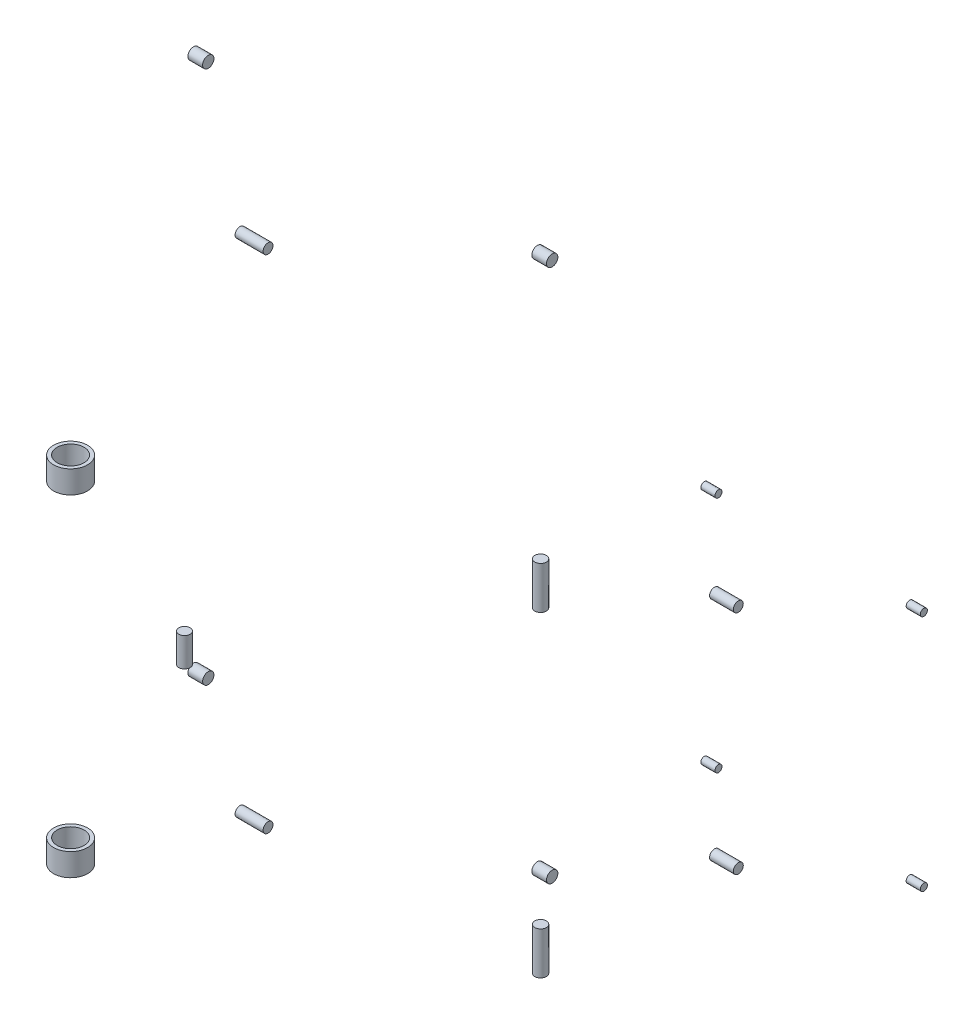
ISO-10303-21;
HEADER;
FILE_DESCRIPTION(('STEP AP214'),'2;1');
FILE_NAME('part.step','',(''),(''),'','','');
FILE_SCHEMA(('AUTOMOTIVE_DESIGN { 1 0 10303 214 1 1 1 1 }'));
ENDSEC;
DATA;
#1=APPLICATION_CONTEXT('core data for automotive mechanical design processes');
#2=APPLICATION_PROTOCOL_DEFINITION('international standard','automotive_design',2000,#1);
#3=PRODUCT_CONTEXT('',#1,'mechanical');
#4=PRODUCT('Part','Part','',(#3));
#5=PRODUCT_RELATED_PRODUCT_CATEGORY('part','',(#4));
#6=PRODUCT_DEFINITION_FORMATION('','',#4);
#7=PRODUCT_DEFINITION_CONTEXT('part definition',#1,'design');
#8=PRODUCT_DEFINITION('design','',#6,#7);
#9=PRODUCT_DEFINITION_SHAPE('','',#8);
#10=(LENGTH_UNIT() NAMED_UNIT(*) SI_UNIT(.MILLI.,.METRE.));
#11=(NAMED_UNIT(*) PLANE_ANGLE_UNIT() SI_UNIT($,.RADIAN.));
#12=(NAMED_UNIT(*) SI_UNIT($,.STERADIAN.) SOLID_ANGLE_UNIT());
#13=UNCERTAINTY_MEASURE_WITH_UNIT(LENGTH_MEASURE(1.E-05),#10,'distance_accuracy_value','');
#14=(GEOMETRIC_REPRESENTATION_CONTEXT(3) GLOBAL_UNCERTAINTY_ASSIGNED_CONTEXT((#13)) GLOBAL_UNIT_ASSIGNED_CONTEXT((#10,
#11,#12)) REPRESENTATION_CONTEXT('',''));
#15=CARTESIAN_POINT('',(0.,0.,0.));
#16=DIRECTION('',(0.,0.,1.));
#17=DIRECTION('',(1.,0.,0.));
#18=AXIS2_PLACEMENT_3D('',#15,#16,#17);
#19=CARTESIAN_POINT('',(-122.,545.,2430.));
#20=DIRECTION('',(0.,1.,0.));
#21=DIRECTION('',(0.,0.,1.));
#22=AXIS2_PLACEMENT_3D('',#19,#20,#21);
#23=CYLINDRICAL_SURFACE('',#22,60.);
#24=CARTESIAN_POINT('',(-122.,545.,2430.));
#25=DIRECTION('',(0.,1.,0.));
#26=DIRECTION('',(0.,0.,1.));
#27=AXIS2_PLACEMENT_3D('',#24,#25,#26);
#28=CIRCLE('',#27,60.);
#29=CARTESIAN_POINT('',(-122.,545.,2490.));
#30=VERTEX_POINT('',#29);
#31=EDGE_CURVE('E11',#30,#30,#28,.T.);
#32=ORIENTED_EDGE('',*,*,#31,.T.);
#33=EDGE_LOOP('',(#32));
#34=FACE_BOUND('',#33,.T.);
#35=CARTESIAN_POINT('',(-122.,625.,2430.));
#36=DIRECTION('',(0.,1.,0.));
#37=DIRECTION('',(0.,0.,1.));
#38=AXIS2_PLACEMENT_3D('',#35,#36,#37);
#39=CIRCLE('',#38,60.);
#40=CARTESIAN_POINT('',(-122.,625.,2490.));
#41=VERTEX_POINT('',#40);
#42=EDGE_CURVE('E46',#41,#41,#39,.T.);
#43=ORIENTED_EDGE('',*,*,#42,.F.);
#44=EDGE_LOOP('',(#43));
#45=FACE_BOUND('',#44,.T.);
#46=ADVANCED_FACE('F43',(#34,#45),#23,.T.);
#47=CARTESIAN_POINT('',(-122.,545.,2430.));
#48=DIRECTION('',(0.,1.,0.));
#49=DIRECTION('',(0.,0.,1.));
#50=AXIS2_PLACEMENT_3D('',#47,#48,#49);
#51=PLANE('',#50);
#52=CARTESIAN_POINT('',(-122.,545.,2430.));
#53=DIRECTION('',(0.,1.,0.));
#54=DIRECTION('',(0.,0.,1.));
#55=AXIS2_PLACEMENT_3D('',#52,#53,#54);
#56=CIRCLE('',#55,47.5);
#57=CARTESIAN_POINT('',(-122.,545.,2477.5));
#58=VERTEX_POINT('',#57);
#59=EDGE_CURVE('E53',#58,#58,#56,.T.);
#60=ORIENTED_EDGE('',*,*,#59,.T.);
#61=EDGE_LOOP('',(#60));
#62=FACE_BOUND('',#61,.T.);
#63=ORIENTED_EDGE('',*,*,#31,.F.);
#64=EDGE_LOOP('',(#63));
#65=FACE_BOUND('',#64,.T.);
#66=ADVANCED_FACE('F61',(#62,#65),#51,.F.);
#67=CARTESIAN_POINT('',(-122.,625.,2430.));
#68=DIRECTION('',(0.,1.,0.));
#69=DIRECTION('',(0.,0.,1.));
#70=AXIS2_PLACEMENT_3D('',#67,#68,#69);
#71=PLANE('',#70);
#72=CARTESIAN_POINT('',(-122.,625.,2430.));
#73=DIRECTION('',(0.,1.,0.));
#74=DIRECTION('',(0.,0.,1.));
#75=AXIS2_PLACEMENT_3D('',#72,#73,#74);
#76=CIRCLE('',#75,47.5);
#77=CARTESIAN_POINT('',(-122.,625.,2477.5));
#78=VERTEX_POINT('',#77);
#79=EDGE_CURVE('E55',#78,#78,#76,.T.);
#80=ORIENTED_EDGE('',*,*,#79,.F.);
#81=EDGE_LOOP('',(#80));
#82=FACE_BOUND('',#81,.T.);
#83=ORIENTED_EDGE('',*,*,#42,.T.);
#84=EDGE_LOOP('',(#83));
#85=FACE_BOUND('',#84,.T.);
#86=ADVANCED_FACE('F67',(#82,#85),#71,.T.);
#87=CARTESIAN_POINT('',(-122.,545.,2430.));
#88=DIRECTION('',(0.,1.,0.));
#89=DIRECTION('',(0.,0.,1.));
#90=AXIS2_PLACEMENT_3D('',#87,#88,#89);
#91=CYLINDRICAL_SURFACE('',#90,47.5);
#92=ORIENTED_EDGE('',*,*,#59,.F.);
#93=EDGE_LOOP('',(#92));
#94=FACE_BOUND('',#93,.T.);
#95=ORIENTED_EDGE('',*,*,#79,.T.);
#96=EDGE_LOOP('',(#95));
#97=FACE_BOUND('',#96,.T.);
#98=ADVANCED_FACE('F64',(#94,#97),#91,.F.);
#99=CLOSED_SHELL('',(#46,#66,#86,#98));
#100=MANIFOLD_SOLID_BREP('B2',#99);
#101=CARTESIAN_POINT('',(-122.,-545.,2430.));
#102=DIRECTION('',(0.,1.,0.));
#103=DIRECTION('',(0.,0.,1.));
#104=AXIS2_PLACEMENT_3D('',#101,#102,#103);
#105=PLANE('',#104);
#106=CARTESIAN_POINT('',(-122.,-545.,2430.));
#107=DIRECTION('',(0.,1.,0.));
#108=DIRECTION('',(0.,0.,1.));
#109=AXIS2_PLACEMENT_3D('',#106,#107,#108);
#110=CIRCLE('',#109,60.);
#111=CARTESIAN_POINT('',(-122.,-545.,2490.));
#112=VERTEX_POINT('',#111);
#113=EDGE_CURVE('E42',#112,#112,#110,.T.);
#114=ORIENTED_EDGE('',*,*,#113,.T.);
#115=EDGE_LOOP('',(#114));
#116=FACE_BOUND('',#115,.T.);
#117=CARTESIAN_POINT('',(-122.,-545.,2430.));
#118=DIRECTION('',(0.,1.,0.));
#119=DIRECTION('',(0.,0.,1.));
#120=AXIS2_PLACEMENT_3D('',#117,#118,#119);
#121=CIRCLE('',#120,47.5);
#122=CARTESIAN_POINT('',(-122.,-545.,2477.5));
#123=VERTEX_POINT('',#122);
#124=EDGE_CURVE('E123',#123,#123,#121,.T.);
#125=ORIENTED_EDGE('',*,*,#124,.F.);
#126=EDGE_LOOP('',(#125));
#127=FACE_BOUND('',#126,.T.);
#128=ADVANCED_FACE('F112',(#116,#127),#105,.T.);
#129=CARTESIAN_POINT('',(-122.,-625.,2430.));
#130=DIRECTION('',(0.,1.,0.));
#131=DIRECTION('',(0.,0.,1.));
#132=AXIS2_PLACEMENT_3D('',#129,#130,#131);
#133=PLANE('',#132);
#134=CARTESIAN_POINT('',(-122.,-625.,2430.));
#135=DIRECTION('',(0.,1.,0.));
#136=DIRECTION('',(0.,0.,1.));
#137=AXIS2_PLACEMENT_3D('',#134,#135,#136);
#138=CIRCLE('',#137,60.);
#139=CARTESIAN_POINT('',(-122.,-625.,2490.));
#140=VERTEX_POINT('',#139);
#141=EDGE_CURVE('E116',#140,#140,#138,.T.);
#142=ORIENTED_EDGE('',*,*,#141,.F.);
#143=EDGE_LOOP('',(#142));
#144=FACE_BOUND('',#143,.T.);
#145=CARTESIAN_POINT('',(-122.,-625.,2430.));
#146=DIRECTION('',(0.,1.,0.));
#147=DIRECTION('',(0.,0.,1.));
#148=AXIS2_PLACEMENT_3D('',#145,#146,#147);
#149=CIRCLE('',#148,47.5);
#150=CARTESIAN_POINT('',(-122.,-625.,2477.5));
#151=VERTEX_POINT('',#150);
#152=EDGE_CURVE('E125',#151,#151,#149,.T.);
#153=ORIENTED_EDGE('',*,*,#152,.T.);
#154=EDGE_LOOP('',(#153));
#155=FACE_BOUND('',#154,.T.);
#156=ADVANCED_FACE('F135',(#144,#155),#133,.F.);
#157=CARTESIAN_POINT('',(-122.,-545.,2430.));
#158=DIRECTION('',(0.,-1.,0.));
#159=DIRECTION('',(0.,0.,-1.));
#160=AXIS2_PLACEMENT_3D('',#157,#158,#159);
#161=CYLINDRICAL_SURFACE('',#160,60.);
#162=ORIENTED_EDGE('',*,*,#113,.F.);
#163=EDGE_LOOP('',(#162));
#164=FACE_BOUND('',#163,.T.);
#165=ORIENTED_EDGE('',*,*,#141,.T.);
#166=EDGE_LOOP('',(#165));
#167=FACE_BOUND('',#166,.T.);
#168=ADVANCED_FACE('F114',(#164,#167),#161,.T.);
#169=CARTESIAN_POINT('',(-122.,-545.,2430.));
#170=DIRECTION('',(0.,-1.,0.));
#171=DIRECTION('',(0.,0.,-1.));
#172=AXIS2_PLACEMENT_3D('',#169,#170,#171);
#173=CYLINDRICAL_SURFACE('',#172,47.5);
#174=ORIENTED_EDGE('',*,*,#124,.T.);
#175=EDGE_LOOP('',(#174));
#176=FACE_BOUND('',#175,.T.);
#177=ORIENTED_EDGE('',*,*,#152,.F.);
#178=EDGE_LOOP('',(#177));
#179=FACE_BOUND('',#178,.T.);
#180=ADVANCED_FACE('F131',(#176,#179),#173,.F.);
#181=CLOSED_SHELL('',(#128,#156,#168,#180));
#182=MANIFOLD_SOLID_BREP('B6',#181);
#183=CARTESIAN_POINT('',(380.,388.,2530.));
#184=DIRECTION('',(0.,-1.,0.));
#185=DIRECTION('',(0.,0.,-1.));
#186=AXIS2_PLACEMENT_3D('',#183,#184,#185);
#187=CYLINDRICAL_SURFACE('',#186,20.);
#188=CARTESIAN_POINT('',(380.,388.,2530.));
#189=DIRECTION('',(0.,1.,0.));
#190=DIRECTION('',(0.,0.,1.));
#191=AXIS2_PLACEMENT_3D('',#188,#189,#190);
#192=CIRCLE('',#191,20.);
#193=CARTESIAN_POINT('',(380.,388.,2550.));
#194=VERTEX_POINT('',#193);
#195=EDGE_CURVE('E111',#194,#194,#192,.T.);
#196=ORIENTED_EDGE('',*,*,#195,.F.);
#197=EDGE_LOOP('',(#196));
#198=FACE_BOUND('',#197,.T.);
#199=CARTESIAN_POINT('',(380.,286.,2530.));
#200=DIRECTION('',(0.,1.,0.));
#201=DIRECTION('',(0.,0.,1.));
#202=AXIS2_PLACEMENT_3D('',#199,#200,#201);
#203=CIRCLE('',#202,20.);
#204=CARTESIAN_POINT('',(380.,286.,2550.));
#205=VERTEX_POINT('',#204);
#206=EDGE_CURVE('E184',#205,#205,#203,.T.);
#207=ORIENTED_EDGE('',*,*,#206,.T.);
#208=EDGE_LOOP('',(#207));
#209=FACE_BOUND('',#208,.T.);
#210=ADVANCED_FACE('F181',(#198,#209),#187,.T.);
#211=CARTESIAN_POINT('',(380.,388.,2530.));
#212=DIRECTION('',(0.,1.,0.));
#213=DIRECTION('',(0.,0.,1.));
#214=AXIS2_PLACEMENT_3D('',#211,#212,#213);
#215=PLANE('',#214);
#216=ORIENTED_EDGE('',*,*,#195,.T.);
#217=EDGE_LOOP('',(#216));
#218=FACE_BOUND('',#217,.T.);
#219=ADVANCED_FACE('F196',(#218),#215,.T.);
#220=CARTESIAN_POINT('',(380.,286.,2530.));
#221=DIRECTION('',(0.,1.,0.));
#222=DIRECTION('',(0.,0.,1.));
#223=AXIS2_PLACEMENT_3D('',#220,#221,#222);
#224=PLANE('',#223);
#225=ORIENTED_EDGE('',*,*,#206,.F.);
#226=EDGE_LOOP('',(#225));
#227=FACE_BOUND('',#226,.T.);
#228=ADVANCED_FACE('F194',(#227),#224,.F.);
#229=CLOSED_SHELL('',(#210,#219,#228));
#230=MANIFOLD_SOLID_BREP('B37',#229);
#231=CARTESIAN_POINT('',(1033.,483.475221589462,1926.));
#232=DIRECTION('',(0.,1.,0.));
#233=DIRECTION('',(0.,0.,1.));
#234=AXIS2_PLACEMENT_3D('',#231,#232,#233);
#235=CYLINDRICAL_SURFACE('',#234,20.5);
#236=CARTESIAN_POINT('',(1033.,483.475221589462,1926.));
#237=DIRECTION('',(0.,1.,0.));
#238=DIRECTION('',(0.,0.,1.));
#239=AXIS2_PLACEMENT_3D('',#236,#237,#238);
#240=CIRCLE('',#239,20.5);
#241=CARTESIAN_POINT('',(1033.,483.475221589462,1946.5));
#242=VERTEX_POINT('',#241);
#243=EDGE_CURVE('E180',#242,#242,#240,.T.);
#244=ORIENTED_EDGE('',*,*,#243,.T.);
#245=EDGE_LOOP('',(#244));
#246=FACE_BOUND('',#245,.T.);
#247=CARTESIAN_POINT('',(1033.,633.475221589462,1926.));
#248=DIRECTION('',(0.,1.,0.));
#249=DIRECTION('',(0.,0.,1.));
#250=AXIS2_PLACEMENT_3D('',#247,#248,#249);
#251=CIRCLE('',#250,20.5);
#252=CARTESIAN_POINT('',(1033.,633.475221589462,1946.5));
#253=VERTEX_POINT('',#252);
#254=EDGE_CURVE('E232',#253,#253,#251,.T.);
#255=ORIENTED_EDGE('',*,*,#254,.F.);
#256=EDGE_LOOP('',(#255));
#257=FACE_BOUND('',#256,.T.);
#258=ADVANCED_FACE('F229',(#246,#257),#235,.T.);
#259=CARTESIAN_POINT('',(1033.,483.475221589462,1926.));
#260=DIRECTION('',(0.,1.,0.));
#261=DIRECTION('',(0.,0.,1.));
#262=AXIS2_PLACEMENT_3D('',#259,#260,#261);
#263=PLANE('',#262);
#264=ORIENTED_EDGE('',*,*,#243,.F.);
#265=EDGE_LOOP('',(#264));
#266=FACE_BOUND('',#265,.T.);
#267=ADVANCED_FACE('F244',(#266),#263,.F.);
#268=CARTESIAN_POINT('',(1033.,633.475221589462,1926.));
#269=DIRECTION('',(0.,1.,0.));
#270=DIRECTION('',(0.,0.,1.));
#271=AXIS2_PLACEMENT_3D('',#268,#269,#270);
#272=PLANE('',#271);
#273=ORIENTED_EDGE('',*,*,#254,.T.);
#274=EDGE_LOOP('',(#273));
#275=FACE_BOUND('',#274,.T.);
#276=ADVANCED_FACE('F241',(#275),#272,.T.);
#277=CLOSED_SHELL('',(#258,#267,#276));
#278=MANIFOLD_SOLID_BREP('B106',#277);
#279=CARTESIAN_POINT('',(1033.,-483.841980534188,1926.));
#280=DIRECTION('',(0.,-1.,0.));
#281=DIRECTION('',(0.,0.,-1.));
#282=AXIS2_PLACEMENT_3D('',#279,#280,#281);
#283=CYLINDRICAL_SURFACE('',#282,20.5);
#284=CARTESIAN_POINT('',(1033.,-483.841980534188,1926.));
#285=DIRECTION('',(0.,1.,0.));
#286=DIRECTION('',(0.,0.,1.));
#287=AXIS2_PLACEMENT_3D('',#284,#285,#286);
#288=CIRCLE('',#287,20.5);
#289=CARTESIAN_POINT('',(1033.,-483.841980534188,1946.5));
#290=VERTEX_POINT('',#289);
#291=EDGE_CURVE('E228',#290,#290,#288,.T.);
#292=ORIENTED_EDGE('',*,*,#291,.F.);
#293=EDGE_LOOP('',(#292));
#294=FACE_BOUND('',#293,.T.);
#295=CARTESIAN_POINT('',(1033.,-633.841980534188,1926.));
#296=DIRECTION('',(0.,1.,0.));
#297=DIRECTION('',(0.,0.,1.));
#298=AXIS2_PLACEMENT_3D('',#295,#296,#297);
#299=CIRCLE('',#298,20.5);
#300=CARTESIAN_POINT('',(1033.,-633.841980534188,1946.5));
#301=VERTEX_POINT('',#300);
#302=EDGE_CURVE('E280',#301,#301,#299,.T.);
#303=ORIENTED_EDGE('',*,*,#302,.T.);
#304=EDGE_LOOP('',(#303));
#305=FACE_BOUND('',#304,.T.);
#306=ADVANCED_FACE('F277',(#294,#305),#283,.T.);
#307=CARTESIAN_POINT('',(1033.,-483.841980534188,1926.));
#308=DIRECTION('',(0.,1.,0.));
#309=DIRECTION('',(0.,0.,1.));
#310=AXIS2_PLACEMENT_3D('',#307,#308,#309);
#311=PLANE('',#310);
#312=ORIENTED_EDGE('',*,*,#291,.T.);
#313=EDGE_LOOP('',(#312));
#314=FACE_BOUND('',#313,.T.);
#315=ADVANCED_FACE('F292',(#314),#311,.T.);
#316=CARTESIAN_POINT('',(1033.,-633.841980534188,1926.));
#317=DIRECTION('',(0.,1.,0.));
#318=DIRECTION('',(0.,0.,1.));
#319=AXIS2_PLACEMENT_3D('',#316,#317,#318);
#320=PLANE('',#319);
#321=ORIENTED_EDGE('',*,*,#302,.F.);
#322=EDGE_LOOP('',(#321));
#323=FACE_BOUND('',#322,.T.);
#324=ADVANCED_FACE('F290',(#323),#320,.F.);
#325=CLOSED_SHELL('',(#306,#315,#324));
#326=MANIFOLD_SOLID_BREP('B175',#325);
#327=CARTESIAN_POINT('',(-145.,885.,1710.));
#328=DIRECTION('',(-1.,0.,0.));
#329=DIRECTION('',(0.,0.,1.));
#330=AXIS2_PLACEMENT_3D('',#327,#328,#329);
#331=CYLINDRICAL_SURFACE('',#330,17.5);
#332=CARTESIAN_POINT('',(-145.,885.,1710.));
#333=DIRECTION('',(-1.,0.,0.));
#334=DIRECTION('',(0.,0.,1.));
#335=AXIS2_PLACEMENT_3D('',#332,#333,#334);
#336=CIRCLE('',#335,17.5);
#337=CARTESIAN_POINT('',(-145.,885.,1727.5));
#338=VERTEX_POINT('',#337);
#339=EDGE_CURVE('E276',#338,#338,#336,.T.);
#340=ORIENTED_EDGE('',*,*,#339,.T.);
#341=EDGE_LOOP('',(#340));
#342=FACE_BOUND('',#341,.T.);
#343=CARTESIAN_POINT('',(-244.,885.,1710.));
#344=DIRECTION('',(-1.,0.,0.));
#345=DIRECTION('',(0.,0.,1.));
#346=AXIS2_PLACEMENT_3D('',#343,#344,#345);
#347=CIRCLE('',#346,17.5);
#348=CARTESIAN_POINT('',(-244.,885.,1727.5));
#349=VERTEX_POINT('',#348);
#350=EDGE_CURVE('E328',#349,#349,#347,.T.);
#351=ORIENTED_EDGE('',*,*,#350,.F.);
#352=EDGE_LOOP('',(#351));
#353=FACE_BOUND('',#352,.T.);
#354=ADVANCED_FACE('F325',(#342,#353),#331,.T.);
#355=CARTESIAN_POINT('',(-145.,885.,1710.));
#356=DIRECTION('',(-1.,0.,0.));
#357=DIRECTION('',(0.,0.,1.));
#358=AXIS2_PLACEMENT_3D('',#355,#356,#357);
#359=PLANE('',#358);
#360=ORIENTED_EDGE('',*,*,#339,.F.);
#361=EDGE_LOOP('',(#360));
#362=FACE_BOUND('',#361,.T.);
#363=ADVANCED_FACE('F340',(#362),#359,.F.);
#364=CARTESIAN_POINT('',(-244.,885.,1710.));
#365=DIRECTION('',(-1.,0.,0.));
#366=DIRECTION('',(0.,0.,1.));
#367=AXIS2_PLACEMENT_3D('',#364,#365,#366);
#368=PLANE('',#367);
#369=ORIENTED_EDGE('',*,*,#350,.T.);
#370=EDGE_LOOP('',(#369));
#371=FACE_BOUND('',#370,.T.);
#372=ADVANCED_FACE('F337',(#371),#368,.T.);
#373=CLOSED_SHELL('',(#354,#363,#372));
#374=MANIFOLD_SOLID_BREP('B223',#373);
#375=CARTESIAN_POINT('',(-145.,-885.,1710.));
#376=DIRECTION('',(-1.,0.,0.));
#377=DIRECTION('',(0.,0.,1.));
#378=AXIS2_PLACEMENT_3D('',#375,#376,#377);
#379=CYLINDRICAL_SURFACE('',#378,17.5);
#380=CARTESIAN_POINT('',(-145.,-885.,1710.));
#381=DIRECTION('',(-1.,0.,0.));
#382=DIRECTION('',(0.,0.,1.));
#383=AXIS2_PLACEMENT_3D('',#380,#381,#382);
#384=CIRCLE('',#383,17.5);
#385=CARTESIAN_POINT('',(-145.,-885.,1727.5));
#386=VERTEX_POINT('',#385);
#387=EDGE_CURVE('E324',#386,#386,#384,.T.);
#388=ORIENTED_EDGE('',*,*,#387,.T.);
#389=EDGE_LOOP('',(#388));
#390=FACE_BOUND('',#389,.T.);
#391=CARTESIAN_POINT('',(-244.,-885.,1710.));
#392=DIRECTION('',(-1.,0.,0.));
#393=DIRECTION('',(0.,0.,1.));
#394=AXIS2_PLACEMENT_3D('',#391,#392,#393);
#395=CIRCLE('',#394,17.5);
#396=CARTESIAN_POINT('',(-244.,-885.,1727.5));
#397=VERTEX_POINT('',#396);
#398=EDGE_CURVE('E376',#397,#397,#395,.T.);
#399=ORIENTED_EDGE('',*,*,#398,.F.);
#400=EDGE_LOOP('',(#399));
#401=FACE_BOUND('',#400,.T.);
#402=ADVANCED_FACE('F373',(#390,#401),#379,.T.);
#403=CARTESIAN_POINT('',(-145.,-885.,1710.));
#404=DIRECTION('',(-1.,0.,0.));
#405=DIRECTION('',(0.,0.,1.));
#406=AXIS2_PLACEMENT_3D('',#403,#404,#405);
#407=PLANE('',#406);
#408=ORIENTED_EDGE('',*,*,#387,.F.);
#409=EDGE_LOOP('',(#408));
#410=FACE_BOUND('',#409,.T.);
#411=ADVANCED_FACE('F388',(#410),#407,.F.);
#412=CARTESIAN_POINT('',(-244.,-885.,1710.));
#413=DIRECTION('',(-1.,0.,0.));
#414=DIRECTION('',(0.,0.,1.));
#415=AXIS2_PLACEMENT_3D('',#412,#413,#414);
#416=PLANE('',#415);
#417=ORIENTED_EDGE('',*,*,#398,.T.);
#418=EDGE_LOOP('',(#417));
#419=FACE_BOUND('',#418,.T.);
#420=ADVANCED_FACE('F385',(#419),#416,.T.);
#421=CLOSED_SHELL('',(#402,#411,#420));
#422=MANIFOLD_SOLID_BREP('B271',#421);
#423=CARTESIAN_POINT('',(-764.000123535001,942.,1302.));
#424=DIRECTION('',(-1.,0.,0.));
#425=DIRECTION('',(0.,0.,1.));
#426=AXIS2_PLACEMENT_3D('',#423,#424,#425);
#427=CYLINDRICAL_SURFACE('',#426,20.);
#428=CARTESIAN_POINT('',(-764.000123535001,942.,1302.));
#429=DIRECTION('',(-1.,0.,0.));
#430=DIRECTION('',(0.,0.,1.));
#431=AXIS2_PLACEMENT_3D('',#428,#429,#430);
#432=CIRCLE('',#431,20.);
#433=CARTESIAN_POINT('',(-764.000123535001,942.,1322.));
#434=VERTEX_POINT('',#433);
#435=EDGE_CURVE('E372',#434,#434,#432,.T.);
#436=CARTESIAN_POINT('',(-816.000123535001,942.,1302.));
#437=DIRECTION('',(-1.,0.,0.));
#438=DIRECTION('',(0.,0.,1.));
#439=AXIS2_PLACEMENT_3D('',#436,#437,#438);
#440=CIRCLE('',#439,20.);
#441=CARTESIAN_POINT('',(-816.000123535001,942.,1322.));
#442=VERTEX_POINT('',#441);
#443=EDGE_CURVE('E424',#442,#442,#440,.T.);
#444=CARTESIAN_POINT('',(-764.000123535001,942.,1322.));
#445=CARTESIAN_POINT('',(-764.541790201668,942.,1322.));
#446=CARTESIAN_POINT('',(-765.083456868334,942.,1322.));
#447=CARTESIAN_POINT('',(-766.166790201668,942.,1322.));
#448=CARTESIAN_POINT('',(-766.708456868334,942.,1322.));
#449=CARTESIAN_POINT('',(-767.791790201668,942.,1322.));
#450=CARTESIAN_POINT('',(-768.333456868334,942.,1322.));
#451=CARTESIAN_POINT('',(-769.416790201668,942.,1322.));
#452=CARTESIAN_POINT('',(-769.958456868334,942.,1322.));
#453=CARTESIAN_POINT('',(-771.041790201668,942.,1322.));
#454=CARTESIAN_POINT('',(-771.583456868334,942.,1322.));
#455=CARTESIAN_POINT('',(-772.666790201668,942.,1322.));
#456=CARTESIAN_POINT('',(-773.208456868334,942.,1322.));
#457=CARTESIAN_POINT('',(-774.291790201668,942.,1322.));
#458=CARTESIAN_POINT('',(-774.833456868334,942.,1322.));
#459=CARTESIAN_POINT('',(-775.916790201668,942.,1322.));
#460=CARTESIAN_POINT('',(-776.458456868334,942.,1322.));
#461=CARTESIAN_POINT('',(-777.541790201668,942.,1322.));
#462=CARTESIAN_POINT('',(-778.083456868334,942.,1322.));
#463=CARTESIAN_POINT('',(-779.166790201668,942.,1322.));
#464=CARTESIAN_POINT('',(-779.708456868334,942.,1322.));
#465=CARTESIAN_POINT('',(-780.791790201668,942.,1322.));
#466=CARTESIAN_POINT('',(-781.333456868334,942.,1322.));
#467=CARTESIAN_POINT('',(-782.416790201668,942.,1322.));
#468=CARTESIAN_POINT('',(-782.958456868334,942.,1322.));
#469=CARTESIAN_POINT('',(-784.041790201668,942.,1322.));
#470=CARTESIAN_POINT('',(-784.583456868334,942.,1322.));
#471=CARTESIAN_POINT('',(-785.666790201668,942.,1322.));
#472=CARTESIAN_POINT('',(-786.208456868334,942.,1322.));
#473=CARTESIAN_POINT('',(-787.291790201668,942.,1322.));
#474=CARTESIAN_POINT('',(-787.833456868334,942.,1322.));
#475=CARTESIAN_POINT('',(-788.916790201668,942.,1322.));
#476=CARTESIAN_POINT('',(-789.458456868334,942.,1322.));
#477=CARTESIAN_POINT('',(-790.541790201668,942.,1322.));
#478=CARTESIAN_POINT('',(-791.083456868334,942.,1322.));
#479=CARTESIAN_POINT('',(-792.166790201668,942.,1322.));
#480=CARTESIAN_POINT('',(-792.708456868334,942.,1322.));
#481=CARTESIAN_POINT('',(-793.791790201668,942.,1322.));
#482=CARTESIAN_POINT('',(-794.333456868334,942.,1322.));
#483=CARTESIAN_POINT('',(-795.416790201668,942.,1322.));
#484=CARTESIAN_POINT('',(-795.958456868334,942.,1322.));
#485=CARTESIAN_POINT('',(-797.041790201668,942.,1322.));
#486=CARTESIAN_POINT('',(-797.583456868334,942.,1322.));
#487=CARTESIAN_POINT('',(-798.666790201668,942.,1322.));
#488=CARTESIAN_POINT('',(-799.208456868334,942.,1322.));
#489=CARTESIAN_POINT('',(-800.291790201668,942.,1322.));
#490=CARTESIAN_POINT('',(-800.833456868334,942.,1322.));
#491=CARTESIAN_POINT('',(-801.916790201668,942.,1322.));
#492=CARTESIAN_POINT('',(-802.458456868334,942.,1322.));
#493=CARTESIAN_POINT('',(-803.541790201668,942.,1322.));
#494=CARTESIAN_POINT('',(-804.083456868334,942.,1322.));
#495=CARTESIAN_POINT('',(-805.166790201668,942.,1322.));
#496=CARTESIAN_POINT('',(-805.708456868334,942.,1322.));
#497=CARTESIAN_POINT('',(-806.791790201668,942.,1322.));
#498=CARTESIAN_POINT('',(-807.333456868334,942.,1322.));
#499=CARTESIAN_POINT('',(-808.416790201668,942.,1322.));
#500=CARTESIAN_POINT('',(-808.958456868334,942.,1322.));
#501=CARTESIAN_POINT('',(-810.041790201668,942.,1322.));
#502=CARTESIAN_POINT('',(-810.583456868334,942.,1322.));
#503=CARTESIAN_POINT('',(-811.666790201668,942.,1322.));
#504=CARTESIAN_POINT('',(-812.208456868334,942.,1322.));
#505=CARTESIAN_POINT('',(-813.291790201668,942.,1322.));
#506=CARTESIAN_POINT('',(-813.833456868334,942.,1322.));
#507=CARTESIAN_POINT('',(-814.916790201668,942.,1322.));
#508=CARTESIAN_POINT('',(-815.458456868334,942.,1322.));
#509=CARTESIAN_POINT('',(-816.000123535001,942.,1322.));
#510=B_SPLINE_CURVE_WITH_KNOTS('',3,(#444,#445,#446,#447,#448,#449,#450,#451,#452,#453,#454,
#455,#456,#457,#458,#459,#460,#461,#462,#463,#464,#465,#466,#467,#468,#469,#470,#471,#472,#473,
#474,#475,#476,#477,#478,#479,#480,#481,#482,#483,#484,#485,#486,#487,#488,#489,#490,#491,#492,
#493,#494,#495,#496,#497,#498,#499,#500,#501,#502,#503,#504,#505,#506,#507,#508,#509),
.UNSPECIFIED.,.F.,.F.,(4,2,2,2,2,2,2,2,2,2,2,2,2,2,2,2,2,2,2,2,2,2,2,2,2,2,2,2,2,2,2,2,4),(0.,
1.6250000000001,3.25000000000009,4.87500000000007,6.50000000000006,8.12500000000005,
9.75000000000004,11.375,13.,14.6250000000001,16.2500000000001,17.8750000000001,19.5000000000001,
21.1250000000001,22.75,24.375,26.,27.6250000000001,29.2500000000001,30.8750000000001,
32.5000000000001,34.1250000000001,35.7500000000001,37.375,39.,40.6250000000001,42.2500000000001,
43.8750000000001,45.5000000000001,47.1250000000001,48.7500000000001,50.3750000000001,52.),.UNSPECIFIED.);
#511=EDGE_CURVE('BSEAM421',#434,#442,#510,.T.);
#512=ORIENTED_EDGE('',*,*,#435,.T.);
#513=ORIENTED_EDGE('',*,*,#443,.F.);
#514=ORIENTED_EDGE('',*,*,#511,.T.);
#515=ORIENTED_EDGE('',*,*,#511,.F.);
#516=EDGE_LOOP('',(#512,#514,#513,#515));
#517=FACE_BOUND('',#516,.T.);
#518=ADVANCED_FACE('F421',(#517),#427,.T.);
#519=CARTESIAN_POINT('',(-764.000123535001,942.,1302.));
#520=DIRECTION('',(-1.,0.,0.));
#521=DIRECTION('',(0.,0.,1.));
#522=AXIS2_PLACEMENT_3D('',#519,#520,#521);
#523=PLANE('',#522);
#524=ORIENTED_EDGE('',*,*,#435,.F.);
#525=EDGE_LOOP('',(#524));
#526=FACE_BOUND('',#525,.T.);
#527=ADVANCED_FACE('F436',(#526),#523,.F.);
#528=CARTESIAN_POINT('',(-816.000123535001,942.,1302.));
#529=DIRECTION('',(-1.,0.,0.));
#530=DIRECTION('',(0.,0.,1.));
#531=AXIS2_PLACEMENT_3D('',#528,#529,#530);
#532=PLANE('',#531);
#533=ORIENTED_EDGE('',*,*,#443,.T.);
#534=EDGE_LOOP('',(#533));
#535=FACE_BOUND('',#534,.T.);
#536=ADVANCED_FACE('F433',(#535),#532,.T.);
#537=CLOSED_SHELL('',(#518,#527,#536));
#538=MANIFOLD_SOLID_BREP('B319',#537);
#539=CARTESIAN_POINT('',(-764.000123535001,-942.,1302.));
#540=DIRECTION('',(-1.,0.,0.));
#541=DIRECTION('',(0.,0.,1.));
#542=AXIS2_PLACEMENT_3D('',#539,#540,#541);
#543=CYLINDRICAL_SURFACE('',#542,20.);
#544=CARTESIAN_POINT('',(-764.000123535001,-942.,1302.));
#545=DIRECTION('',(-1.,0.,0.));
#546=DIRECTION('',(0.,0.,1.));
#547=AXIS2_PLACEMENT_3D('',#544,#545,#546);
#548=CIRCLE('',#547,20.);
#549=CARTESIAN_POINT('',(-764.000123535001,-942.,1322.));
#550=VERTEX_POINT('',#549);
#551=EDGE_CURVE('E420',#550,#550,#548,.T.);
#552=CARTESIAN_POINT('',(-816.000123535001,-942.,1302.));
#553=DIRECTION('',(-1.,0.,0.));
#554=DIRECTION('',(0.,0.,1.));
#555=AXIS2_PLACEMENT_3D('',#552,#553,#554);
#556=CIRCLE('',#555,20.);
#557=CARTESIAN_POINT('',(-816.000123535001,-942.,1322.));
#558=VERTEX_POINT('',#557);
#559=EDGE_CURVE('E472',#558,#558,#556,.T.);
#560=CARTESIAN_POINT('',(-764.000123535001,-942.,1322.));
#561=CARTESIAN_POINT('',(-764.541790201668,-942.,1322.));
#562=CARTESIAN_POINT('',(-765.083456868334,-942.,1322.));
#563=CARTESIAN_POINT('',(-766.166790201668,-942.,1322.));
#564=CARTESIAN_POINT('',(-766.708456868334,-942.,1322.));
#565=CARTESIAN_POINT('',(-767.791790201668,-942.,1322.));
#566=CARTESIAN_POINT('',(-768.333456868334,-942.,1322.));
#567=CARTESIAN_POINT('',(-769.416790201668,-942.,1322.));
#568=CARTESIAN_POINT('',(-769.958456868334,-942.,1322.));
#569=CARTESIAN_POINT('',(-771.041790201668,-942.,1322.));
#570=CARTESIAN_POINT('',(-771.583456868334,-942.,1322.));
#571=CARTESIAN_POINT('',(-772.666790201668,-942.,1322.));
#572=CARTESIAN_POINT('',(-773.208456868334,-942.,1322.));
#573=CARTESIAN_POINT('',(-774.291790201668,-942.,1322.));
#574=CARTESIAN_POINT('',(-774.833456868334,-942.,1322.));
#575=CARTESIAN_POINT('',(-775.916790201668,-942.,1322.));
#576=CARTESIAN_POINT('',(-776.458456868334,-942.,1322.));
#577=CARTESIAN_POINT('',(-777.541790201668,-942.,1322.));
#578=CARTESIAN_POINT('',(-778.083456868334,-942.,1322.));
#579=CARTESIAN_POINT('',(-779.166790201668,-942.,1322.));
#580=CARTESIAN_POINT('',(-779.708456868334,-942.,1322.));
#581=CARTESIAN_POINT('',(-780.791790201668,-942.,1322.));
#582=CARTESIAN_POINT('',(-781.333456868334,-942.,1322.));
#583=CARTESIAN_POINT('',(-782.416790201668,-942.,1322.));
#584=CARTESIAN_POINT('',(-782.958456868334,-942.,1322.));
#585=CARTESIAN_POINT('',(-784.041790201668,-942.,1322.));
#586=CARTESIAN_POINT('',(-784.583456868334,-942.,1322.));
#587=CARTESIAN_POINT('',(-785.666790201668,-942.,1322.));
#588=CARTESIAN_POINT('',(-786.208456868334,-942.,1322.));
#589=CARTESIAN_POINT('',(-787.291790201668,-942.,1322.));
#590=CARTESIAN_POINT('',(-787.833456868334,-942.,1322.));
#591=CARTESIAN_POINT('',(-788.916790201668,-942.,1322.));
#592=CARTESIAN_POINT('',(-789.458456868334,-942.,1322.));
#593=CARTESIAN_POINT('',(-790.541790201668,-942.,1322.));
#594=CARTESIAN_POINT('',(-791.083456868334,-942.,1322.));
#595=CARTESIAN_POINT('',(-792.166790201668,-942.,1322.));
#596=CARTESIAN_POINT('',(-792.708456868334,-942.,1322.));
#597=CARTESIAN_POINT('',(-793.791790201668,-942.,1322.));
#598=CARTESIAN_POINT('',(-794.333456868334,-942.,1322.));
#599=CARTESIAN_POINT('',(-795.416790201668,-942.,1322.));
#600=CARTESIAN_POINT('',(-795.958456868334,-942.,1322.));
#601=CARTESIAN_POINT('',(-797.041790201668,-942.,1322.));
#602=CARTESIAN_POINT('',(-797.583456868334,-942.,1322.));
#603=CARTESIAN_POINT('',(-798.666790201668,-942.,1322.));
#604=CARTESIAN_POINT('',(-799.208456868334,-942.,1322.));
#605=CARTESIAN_POINT('',(-800.291790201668,-942.,1322.));
#606=CARTESIAN_POINT('',(-800.833456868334,-942.,1322.));
#607=CARTESIAN_POINT('',(-801.916790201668,-942.,1322.));
#608=CARTESIAN_POINT('',(-802.458456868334,-942.,1322.));
#609=CARTESIAN_POINT('',(-803.541790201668,-942.,1322.));
#610=CARTESIAN_POINT('',(-804.083456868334,-942.,1322.));
#611=CARTESIAN_POINT('',(-805.166790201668,-942.,1322.));
#612=CARTESIAN_POINT('',(-805.708456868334,-942.,1322.));
#613=CARTESIAN_POINT('',(-806.791790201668,-942.,1322.));
#614=CARTESIAN_POINT('',(-807.333456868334,-942.,1322.));
#615=CARTESIAN_POINT('',(-808.416790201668,-942.,1322.));
#616=CARTESIAN_POINT('',(-808.958456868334,-942.,1322.));
#617=CARTESIAN_POINT('',(-810.041790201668,-942.,1322.));
#618=CARTESIAN_POINT('',(-810.583456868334,-942.,1322.));
#619=CARTESIAN_POINT('',(-811.666790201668,-942.,1322.));
#620=CARTESIAN_POINT('',(-812.208456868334,-942.,1322.));
#621=CARTESIAN_POINT('',(-813.291790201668,-942.,1322.));
#622=CARTESIAN_POINT('',(-813.833456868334,-942.,1322.));
#623=CARTESIAN_POINT('',(-814.916790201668,-942.,1322.));
#624=CARTESIAN_POINT('',(-815.458456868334,-942.,1322.));
#625=CARTESIAN_POINT('',(-816.000123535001,-942.,1322.));
#626=B_SPLINE_CURVE_WITH_KNOTS('',3,(#560,#561,#562,#563,#564,#565,#566,#567,#568,#569,#570,
#571,#572,#573,#574,#575,#576,#577,#578,#579,#580,#581,#582,#583,#584,#585,#586,#587,#588,#589,
#590,#591,#592,#593,#594,#595,#596,#597,#598,#599,#600,#601,#602,#603,#604,#605,#606,#607,#608,
#609,#610,#611,#612,#613,#614,#615,#616,#617,#618,#619,#620,#621,#622,#623,#624,#625),
.UNSPECIFIED.,.F.,.F.,(4,2,2,2,2,2,2,2,2,2,2,2,2,2,2,2,2,2,2,2,2,2,2,2,2,2,2,2,2,2,2,2,4),(0.,
1.6250000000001,3.25000000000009,4.87500000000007,6.50000000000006,8.12500000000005,
9.75000000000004,11.375,13.,14.6250000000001,16.2500000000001,17.8750000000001,19.5000000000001,
21.1250000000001,22.75,24.375,26.,27.6250000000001,29.2500000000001,30.8750000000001,
32.5000000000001,34.1250000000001,35.7500000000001,37.375,39.,40.6250000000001,42.2500000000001,
43.8750000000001,45.5000000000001,47.1250000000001,48.7500000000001,50.3750000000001,52.),.UNSPECIFIED.);
#627=EDGE_CURVE('BSEAM469',#550,#558,#626,.T.);
#628=ORIENTED_EDGE('',*,*,#551,.T.);
#629=ORIENTED_EDGE('',*,*,#559,.F.);
#630=ORIENTED_EDGE('',*,*,#627,.T.);
#631=ORIENTED_EDGE('',*,*,#627,.F.);
#632=EDGE_LOOP('',(#628,#630,#629,#631));
#633=FACE_BOUND('',#632,.T.);
#634=ADVANCED_FACE('F469',(#633),#543,.T.);
#635=CARTESIAN_POINT('',(-764.000123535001,-942.,1302.));
#636=DIRECTION('',(-1.,0.,0.));
#637=DIRECTION('',(0.,0.,1.));
#638=AXIS2_PLACEMENT_3D('',#635,#636,#637);
#639=PLANE('',#638);
#640=ORIENTED_EDGE('',*,*,#551,.F.);
#641=EDGE_LOOP('',(#640));
#642=FACE_BOUND('',#641,.T.);
#643=ADVANCED_FACE('F484',(#642),#639,.F.);
#644=CARTESIAN_POINT('',(-816.000123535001,-942.,1302.));
#645=DIRECTION('',(-1.,0.,0.));
#646=DIRECTION('',(0.,0.,1.));
#647=AXIS2_PLACEMENT_3D('',#644,#645,#646);
#648=PLANE('',#647);
#649=ORIENTED_EDGE('',*,*,#559,.T.);
#650=EDGE_LOOP('',(#649));
#651=FACE_BOUND('',#650,.T.);
#652=ADVANCED_FACE('F481',(#651),#648,.T.);
#653=CLOSED_SHELL('',(#634,#643,#652));
#654=MANIFOLD_SOLID_BREP('B367',#653);
#655=CARTESIAN_POINT('',(398.,942.,1302.));
#656=DIRECTION('',(1.,0.,0.));
#657=DIRECTION('',(0.,0.,-1.));
#658=AXIS2_PLACEMENT_3D('',#655,#656,#657);
#659=CYLINDRICAL_SURFACE('',#658,20.);
#660=CARTESIAN_POINT('',(398.,942.,1302.));
#661=DIRECTION('',(-1.,0.,0.));
#662=DIRECTION('',(0.,0.,1.));
#663=AXIS2_PLACEMENT_3D('',#660,#661,#662);
#664=CIRCLE('',#663,20.);
#665=CARTESIAN_POINT('',(398.,942.,1282.));
#666=VERTEX_POINT('',#665);
#667=EDGE_CURVE('E468',#666,#666,#664,.T.);
#668=CARTESIAN_POINT('',(450.,942.,1302.));
#669=DIRECTION('',(-1.,0.,0.));
#670=DIRECTION('',(0.,0.,1.));
#671=AXIS2_PLACEMENT_3D('',#668,#669,#670);
#672=CIRCLE('',#671,20.);
#673=CARTESIAN_POINT('',(450.,942.,1282.));
#674=VERTEX_POINT('',#673);
#675=EDGE_CURVE('E520',#674,#674,#672,.T.);
#676=CARTESIAN_POINT('',(398.,942.,1282.));
#677=CARTESIAN_POINT('',(398.541666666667,942.,1282.));
#678=CARTESIAN_POINT('',(399.083333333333,942.,1282.));
#679=CARTESIAN_POINT('',(400.166666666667,942.,1282.));
#680=CARTESIAN_POINT('',(400.708333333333,942.,1282.));
#681=CARTESIAN_POINT('',(401.791666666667,942.,1282.));
#682=CARTESIAN_POINT('',(402.333333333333,942.,1282.));
#683=CARTESIAN_POINT('',(403.416666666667,942.,1282.));
#684=CARTESIAN_POINT('',(403.958333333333,942.,1282.));
#685=CARTESIAN_POINT('',(405.041666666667,942.,1282.));
#686=CARTESIAN_POINT('',(405.583333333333,942.,1282.));
#687=CARTESIAN_POINT('',(406.666666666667,942.,1282.));
#688=CARTESIAN_POINT('',(407.208333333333,942.,1282.));
#689=CARTESIAN_POINT('',(408.291666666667,942.,1282.));
#690=CARTESIAN_POINT('',(408.833333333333,942.,1282.));
#691=CARTESIAN_POINT('',(409.916666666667,942.,1282.));
#692=CARTESIAN_POINT('',(410.458333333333,942.,1282.));
#693=CARTESIAN_POINT('',(411.541666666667,942.,1282.));
#694=CARTESIAN_POINT('',(412.083333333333,942.,1282.));
#695=CARTESIAN_POINT('',(413.166666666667,942.,1282.));
#696=CARTESIAN_POINT('',(413.708333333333,942.,1282.));
#697=CARTESIAN_POINT('',(414.791666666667,942.,1282.));
#698=CARTESIAN_POINT('',(415.333333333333,942.,1282.));
#699=CARTESIAN_POINT('',(416.416666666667,942.,1282.));
#700=CARTESIAN_POINT('',(416.958333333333,942.,1282.));
#701=CARTESIAN_POINT('',(418.041666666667,942.,1282.));
#702=CARTESIAN_POINT('',(418.583333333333,942.,1282.));
#703=CARTESIAN_POINT('',(419.666666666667,942.,1282.));
#704=CARTESIAN_POINT('',(420.208333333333,942.,1282.));
#705=CARTESIAN_POINT('',(421.291666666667,942.,1282.));
#706=CARTESIAN_POINT('',(421.833333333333,942.,1282.));
#707=CARTESIAN_POINT('',(422.916666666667,942.,1282.));
#708=CARTESIAN_POINT('',(423.458333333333,942.,1282.));
#709=CARTESIAN_POINT('',(424.541666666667,942.,1282.));
#710=CARTESIAN_POINT('',(425.083333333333,942.,1282.));
#711=CARTESIAN_POINT('',(426.166666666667,942.,1282.));
#712=CARTESIAN_POINT('',(426.708333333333,942.,1282.));
#713=CARTESIAN_POINT('',(427.791666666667,942.,1282.));
#714=CARTESIAN_POINT('',(428.333333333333,942.,1282.));
#715=CARTESIAN_POINT('',(429.416666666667,942.,1282.));
#716=CARTESIAN_POINT('',(429.958333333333,942.,1282.));
#717=CARTESIAN_POINT('',(431.041666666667,942.,1282.));
#718=CARTESIAN_POINT('',(431.583333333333,942.,1282.));
#719=CARTESIAN_POINT('',(432.666666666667,942.,1282.));
#720=CARTESIAN_POINT('',(433.208333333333,942.,1282.));
#721=CARTESIAN_POINT('',(434.291666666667,942.,1282.));
#722=CARTESIAN_POINT('',(434.833333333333,942.,1282.));
#723=CARTESIAN_POINT('',(435.916666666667,942.,1282.));
#724=CARTESIAN_POINT('',(436.458333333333,942.,1282.));
#725=CARTESIAN_POINT('',(437.541666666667,942.,1282.));
#726=CARTESIAN_POINT('',(438.083333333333,942.,1282.));
#727=CARTESIAN_POINT('',(439.166666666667,942.,1282.));
#728=CARTESIAN_POINT('',(439.708333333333,942.,1282.));
#729=CARTESIAN_POINT('',(440.791666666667,942.,1282.));
#730=CARTESIAN_POINT('',(441.333333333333,942.,1282.));
#731=CARTESIAN_POINT('',(442.416666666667,942.,1282.));
#732=CARTESIAN_POINT('',(442.958333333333,942.,1282.));
#733=CARTESIAN_POINT('',(444.041666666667,942.,1282.));
#734=CARTESIAN_POINT('',(444.583333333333,942.,1282.));
#735=CARTESIAN_POINT('',(445.666666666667,942.,1282.));
#736=CARTESIAN_POINT('',(446.208333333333,942.,1282.));
#737=CARTESIAN_POINT('',(447.291666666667,942.,1282.));
#738=CARTESIAN_POINT('',(447.833333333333,942.,1282.));
#739=CARTESIAN_POINT('',(448.916666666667,942.,1282.));
#740=CARTESIAN_POINT('',(449.458333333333,942.,1282.));
#741=CARTESIAN_POINT('',(450.,942.,1282.));
#742=B_SPLINE_CURVE_WITH_KNOTS('',3,(#676,#677,#678,#679,#680,#681,#682,#683,#684,#685,#686,
#687,#688,#689,#690,#691,#692,#693,#694,#695,#696,#697,#698,#699,#700,#701,#702,#703,#704,#705,
#706,#707,#708,#709,#710,#711,#712,#713,#714,#715,#716,#717,#718,#719,#720,#721,#722,#723,#724,
#725,#726,#727,#728,#729,#730,#731,#732,#733,#734,#735,#736,#737,#738,#739,#740,#741),
.UNSPECIFIED.,.F.,.F.,(4,2,2,2,2,2,2,2,2,2,2,2,2,2,2,2,2,2,2,2,2,2,2,2,2,2,2,2,2,2,2,2,4),(0.,
1.62499999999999,3.24999999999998,4.87499999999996,6.49999999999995,8.12499999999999,
9.74999999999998,11.375,13.,14.6249999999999,16.25,17.875,19.5,21.125,22.75,24.375,26.,27.625,
29.2499999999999,30.875,32.5,34.125,35.75,37.3749999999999,39.,40.625,42.25,43.8749999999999,
45.4999999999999,47.125,48.75,50.375,51.9999999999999),.UNSPECIFIED.);
#743=EDGE_CURVE('BSEAM517',#666,#674,#742,.T.);
#744=ORIENTED_EDGE('',*,*,#667,.F.);
#745=ORIENTED_EDGE('',*,*,#675,.T.);
#746=ORIENTED_EDGE('',*,*,#743,.T.);
#747=ORIENTED_EDGE('',*,*,#743,.F.);
#748=EDGE_LOOP('',(#744,#746,#745,#747));
#749=FACE_BOUND('',#748,.T.);
#750=ADVANCED_FACE('F517',(#749),#659,.T.);
#751=CARTESIAN_POINT('',(398.,942.,1302.));
#752=DIRECTION('',(-1.,0.,0.));
#753=DIRECTION('',(0.,0.,1.));
#754=AXIS2_PLACEMENT_3D('',#751,#752,#753);
#755=PLANE('',#754);
#756=ORIENTED_EDGE('',*,*,#667,.T.);
#757=EDGE_LOOP('',(#756));
#758=FACE_BOUND('',#757,.T.);
#759=ADVANCED_FACE('F532',(#758),#755,.T.);
#760=CARTESIAN_POINT('',(450.,942.,1302.));
#761=DIRECTION('',(-1.,0.,0.));
#762=DIRECTION('',(0.,0.,1.));
#763=AXIS2_PLACEMENT_3D('',#760,#761,#762);
#764=PLANE('',#763);
#765=ORIENTED_EDGE('',*,*,#675,.F.);
#766=EDGE_LOOP('',(#765));
#767=FACE_BOUND('',#766,.T.);
#768=ADVANCED_FACE('F530',(#767),#764,.F.);
#769=CLOSED_SHELL('',(#750,#759,#768));
#770=MANIFOLD_SOLID_BREP('B415',#769);
#771=CARTESIAN_POINT('',(398.,-942.,1302.));
#772=DIRECTION('',(1.,0.,0.));
#773=DIRECTION('',(0.,0.,-1.));
#774=AXIS2_PLACEMENT_3D('',#771,#772,#773);
#775=CYLINDRICAL_SURFACE('',#774,20.);
#776=CARTESIAN_POINT('',(398.,-942.,1302.));
#777=DIRECTION('',(-1.,0.,0.));
#778=DIRECTION('',(0.,0.,1.));
#779=AXIS2_PLACEMENT_3D('',#776,#777,#778);
#780=CIRCLE('',#779,20.);
#781=CARTESIAN_POINT('',(398.,-942.,1282.));
#782=VERTEX_POINT('',#781);
#783=EDGE_CURVE('E516',#782,#782,#780,.T.);
#784=CARTESIAN_POINT('',(450.,-942.,1302.));
#785=DIRECTION('',(-1.,0.,0.));
#786=DIRECTION('',(0.,0.,1.));
#787=AXIS2_PLACEMENT_3D('',#784,#785,#786);
#788=CIRCLE('',#787,20.);
#789=CARTESIAN_POINT('',(450.,-942.,1282.));
#790=VERTEX_POINT('',#789);
#791=EDGE_CURVE('E568',#790,#790,#788,.T.);
#792=CARTESIAN_POINT('',(398.,-942.,1282.));
#793=CARTESIAN_POINT('',(398.541666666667,-942.,1282.));
#794=CARTESIAN_POINT('',(399.083333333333,-942.,1282.));
#795=CARTESIAN_POINT('',(400.166666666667,-942.,1282.));
#796=CARTESIAN_POINT('',(400.708333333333,-942.,1282.));
#797=CARTESIAN_POINT('',(401.791666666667,-942.,1282.));
#798=CARTESIAN_POINT('',(402.333333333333,-942.,1282.));
#799=CARTESIAN_POINT('',(403.416666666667,-942.,1282.));
#800=CARTESIAN_POINT('',(403.958333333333,-942.,1282.));
#801=CARTESIAN_POINT('',(405.041666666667,-942.,1282.));
#802=CARTESIAN_POINT('',(405.583333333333,-942.,1282.));
#803=CARTESIAN_POINT('',(406.666666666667,-942.,1282.));
#804=CARTESIAN_POINT('',(407.208333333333,-942.,1282.));
#805=CARTESIAN_POINT('',(408.291666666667,-942.,1282.));
#806=CARTESIAN_POINT('',(408.833333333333,-942.,1282.));
#807=CARTESIAN_POINT('',(409.916666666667,-942.,1282.));
#808=CARTESIAN_POINT('',(410.458333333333,-942.,1282.));
#809=CARTESIAN_POINT('',(411.541666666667,-942.,1282.));
#810=CARTESIAN_POINT('',(412.083333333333,-942.,1282.));
#811=CARTESIAN_POINT('',(413.166666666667,-942.,1282.));
#812=CARTESIAN_POINT('',(413.708333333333,-942.,1282.));
#813=CARTESIAN_POINT('',(414.791666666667,-942.,1282.));
#814=CARTESIAN_POINT('',(415.333333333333,-942.,1282.));
#815=CARTESIAN_POINT('',(416.416666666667,-942.,1282.));
#816=CARTESIAN_POINT('',(416.958333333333,-942.,1282.));
#817=CARTESIAN_POINT('',(418.041666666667,-942.,1282.));
#818=CARTESIAN_POINT('',(418.583333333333,-942.,1282.));
#819=CARTESIAN_POINT('',(419.666666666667,-942.,1282.));
#820=CARTESIAN_POINT('',(420.208333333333,-942.,1282.));
#821=CARTESIAN_POINT('',(421.291666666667,-942.,1282.));
#822=CARTESIAN_POINT('',(421.833333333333,-942.,1282.));
#823=CARTESIAN_POINT('',(422.916666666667,-942.,1282.));
#824=CARTESIAN_POINT('',(423.458333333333,-942.,1282.));
#825=CARTESIAN_POINT('',(424.541666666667,-942.,1282.));
#826=CARTESIAN_POINT('',(425.083333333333,-942.,1282.));
#827=CARTESIAN_POINT('',(426.166666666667,-942.,1282.));
#828=CARTESIAN_POINT('',(426.708333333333,-942.,1282.));
#829=CARTESIAN_POINT('',(427.791666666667,-942.,1282.));
#830=CARTESIAN_POINT('',(428.333333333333,-942.,1282.));
#831=CARTESIAN_POINT('',(429.416666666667,-942.,1282.));
#832=CARTESIAN_POINT('',(429.958333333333,-942.,1282.));
#833=CARTESIAN_POINT('',(431.041666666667,-942.,1282.));
#834=CARTESIAN_POINT('',(431.583333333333,-942.,1282.));
#835=CARTESIAN_POINT('',(432.666666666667,-942.,1282.));
#836=CARTESIAN_POINT('',(433.208333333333,-942.,1282.));
#837=CARTESIAN_POINT('',(434.291666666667,-942.,1282.));
#838=CARTESIAN_POINT('',(434.833333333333,-942.,1282.));
#839=CARTESIAN_POINT('',(435.916666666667,-942.,1282.));
#840=CARTESIAN_POINT('',(436.458333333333,-942.,1282.));
#841=CARTESIAN_POINT('',(437.541666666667,-942.,1282.));
#842=CARTESIAN_POINT('',(438.083333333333,-942.,1282.));
#843=CARTESIAN_POINT('',(439.166666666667,-942.,1282.));
#844=CARTESIAN_POINT('',(439.708333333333,-942.,1282.));
#845=CARTESIAN_POINT('',(440.791666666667,-942.,1282.));
#846=CARTESIAN_POINT('',(441.333333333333,-942.,1282.));
#847=CARTESIAN_POINT('',(442.416666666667,-942.,1282.));
#848=CARTESIAN_POINT('',(442.958333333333,-942.,1282.));
#849=CARTESIAN_POINT('',(444.041666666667,-942.,1282.));
#850=CARTESIAN_POINT('',(444.583333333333,-942.,1282.));
#851=CARTESIAN_POINT('',(445.666666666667,-942.,1282.));
#852=CARTESIAN_POINT('',(446.208333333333,-942.,1282.));
#853=CARTESIAN_POINT('',(447.291666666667,-942.,1282.));
#854=CARTESIAN_POINT('',(447.833333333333,-942.,1282.));
#855=CARTESIAN_POINT('',(448.916666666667,-942.,1282.));
#856=CARTESIAN_POINT('',(449.458333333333,-942.,1282.));
#857=CARTESIAN_POINT('',(450.,-942.,1282.));
#858=B_SPLINE_CURVE_WITH_KNOTS('',3,(#792,#793,#794,#795,#796,#797,#798,#799,#800,#801,#802,
#803,#804,#805,#806,#807,#808,#809,#810,#811,#812,#813,#814,#815,#816,#817,#818,#819,#820,#821,
#822,#823,#824,#825,#826,#827,#828,#829,#830,#831,#832,#833,#834,#835,#836,#837,#838,#839,#840,
#841,#842,#843,#844,#845,#846,#847,#848,#849,#850,#851,#852,#853,#854,#855,#856,#857),
.UNSPECIFIED.,.F.,.F.,(4,2,2,2,2,2,2,2,2,2,2,2,2,2,2,2,2,2,2,2,2,2,2,2,2,2,2,2,2,2,2,2,4),(0.,
1.62499999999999,3.24999999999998,4.87499999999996,6.49999999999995,8.12499999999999,
9.74999999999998,11.375,13.,14.6249999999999,16.25,17.875,19.5,21.125,22.75,24.375,26.,27.625,
29.2499999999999,30.875,32.5,34.125,35.75,37.3749999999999,39.,40.625,42.25,43.8749999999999,
45.4999999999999,47.125,48.75,50.375,51.9999999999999),.UNSPECIFIED.);
#859=EDGE_CURVE('BSEAM565',#782,#790,#858,.T.);
#860=ORIENTED_EDGE('',*,*,#783,.F.);
#861=ORIENTED_EDGE('',*,*,#791,.T.);
#862=ORIENTED_EDGE('',*,*,#859,.T.);
#863=ORIENTED_EDGE('',*,*,#859,.F.);
#864=EDGE_LOOP('',(#860,#862,#861,#863));
#865=FACE_BOUND('',#864,.T.);
#866=ADVANCED_FACE('F565',(#865),#775,.T.);
#867=CARTESIAN_POINT('',(398.,-942.,1302.));
#868=DIRECTION('',(-1.,0.,0.));
#869=DIRECTION('',(0.,0.,1.));
#870=AXIS2_PLACEMENT_3D('',#867,#868,#869);
#871=PLANE('',#870);
#872=ORIENTED_EDGE('',*,*,#783,.T.);
#873=EDGE_LOOP('',(#872));
#874=FACE_BOUND('',#873,.T.);
#875=ADVANCED_FACE('F580',(#874),#871,.T.);
#876=CARTESIAN_POINT('',(450.,-942.,1302.));
#877=DIRECTION('',(-1.,0.,0.));
#878=DIRECTION('',(0.,0.,1.));
#879=AXIS2_PLACEMENT_3D('',#876,#877,#878);
#880=PLANE('',#879);
#881=ORIENTED_EDGE('',*,*,#791,.F.);
#882=EDGE_LOOP('',(#881));
#883=FACE_BOUND('',#882,.T.);
#884=ADVANCED_FACE('F578',(#883),#880,.F.);
#885=CLOSED_SHELL('',(#866,#875,#884));
#886=MANIFOLD_SOLID_BREP('B463',#885);
#887=CARTESIAN_POINT('',(1211.,-400.,1490.));
#888=DIRECTION('',(1.,0.,0.));
#889=DIRECTION('',(0.,0.,-1.));
#890=AXIS2_PLACEMENT_3D('',#887,#888,#889);
#891=CYLINDRICAL_SURFACE('',#890,17.5);
#892=CARTESIAN_POINT('',(1211.,-400.,1490.));
#893=DIRECTION('',(-1.,0.,0.));
#894=DIRECTION('',(0.,0.,1.));
#895=AXIS2_PLACEMENT_3D('',#892,#893,#894);
#896=CIRCLE('',#895,17.5);
#897=CARTESIAN_POINT('',(1211.,-400.,1472.5));
#898=VERTEX_POINT('',#897);
#899=EDGE_CURVE('E564',#898,#898,#896,.T.);
#900=CARTESIAN_POINT('',(1295.,-400.,1490.));
#901=DIRECTION('',(-1.,0.,0.));
#902=DIRECTION('',(0.,0.,1.));
#903=AXIS2_PLACEMENT_3D('',#900,#901,#902);
#904=CIRCLE('',#903,17.5);
#905=CARTESIAN_POINT('',(1295.,-400.,1472.5));
#906=VERTEX_POINT('',#905);
#907=EDGE_CURVE('E616',#906,#906,#904,.T.);
#908=CARTESIAN_POINT('',(1211.,-400.,1472.5));
#909=CARTESIAN_POINT('',(1211.875,-400.,1472.5));
#910=CARTESIAN_POINT('',(1212.75,-400.,1472.5));
#911=CARTESIAN_POINT('',(1214.5,-400.,1472.5));
#912=CARTESIAN_POINT('',(1215.375,-400.,1472.5));
#913=CARTESIAN_POINT('',(1217.125,-400.,1472.5));
#914=CARTESIAN_POINT('',(1218.,-400.,1472.5));
#915=CARTESIAN_POINT('',(1219.75,-400.,1472.5));
#916=CARTESIAN_POINT('',(1220.625,-400.,1472.5));
#917=CARTESIAN_POINT('',(1222.375,-400.,1472.5));
#918=CARTESIAN_POINT('',(1223.25,-400.,1472.5));
#919=CARTESIAN_POINT('',(1225.,-400.,1472.5));
#920=CARTESIAN_POINT('',(1225.875,-400.,1472.5));
#921=CARTESIAN_POINT('',(1227.625,-400.,1472.5));
#922=CARTESIAN_POINT('',(1228.5,-400.,1472.5));
#923=CARTESIAN_POINT('',(1230.25,-400.,1472.5));
#924=CARTESIAN_POINT('',(1231.125,-400.,1472.5));
#925=CARTESIAN_POINT('',(1232.875,-400.,1472.5));
#926=CARTESIAN_POINT('',(1233.75,-400.,1472.5));
#927=CARTESIAN_POINT('',(1235.5,-400.,1472.5));
#928=CARTESIAN_POINT('',(1236.375,-400.,1472.5));
#929=CARTESIAN_POINT('',(1238.125,-400.,1472.5));
#930=CARTESIAN_POINT('',(1239.,-400.,1472.5));
#931=CARTESIAN_POINT('',(1240.75,-400.,1472.5));
#932=CARTESIAN_POINT('',(1241.625,-400.,1472.5));
#933=CARTESIAN_POINT('',(1243.375,-400.,1472.5));
#934=CARTESIAN_POINT('',(1244.25,-400.,1472.5));
#935=CARTESIAN_POINT('',(1246.,-400.,1472.5));
#936=CARTESIAN_POINT('',(1246.875,-400.,1472.5));
#937=CARTESIAN_POINT('',(1248.625,-400.,1472.5));
#938=CARTESIAN_POINT('',(1249.5,-400.,1472.5));
#939=CARTESIAN_POINT('',(1251.25,-400.,1472.5));
#940=CARTESIAN_POINT('',(1252.125,-400.,1472.5));
#941=CARTESIAN_POINT('',(1253.875,-400.,1472.5));
#942=CARTESIAN_POINT('',(1254.75,-400.,1472.5));
#943=CARTESIAN_POINT('',(1256.5,-400.,1472.5));
#944=CARTESIAN_POINT('',(1257.375,-400.,1472.5));
#945=CARTESIAN_POINT('',(1259.125,-400.,1472.5));
#946=CARTESIAN_POINT('',(1260.,-400.,1472.5));
#947=CARTESIAN_POINT('',(1261.75,-400.,1472.5));
#948=CARTESIAN_POINT('',(1262.625,-400.,1472.5));
#949=CARTESIAN_POINT('',(1264.375,-400.,1472.5));
#950=CARTESIAN_POINT('',(1265.25,-400.,1472.5));
#951=CARTESIAN_POINT('',(1267.,-400.,1472.5));
#952=CARTESIAN_POINT('',(1267.875,-400.,1472.5));
#953=CARTESIAN_POINT('',(1269.625,-400.,1472.5));
#954=CARTESIAN_POINT('',(1270.5,-400.,1472.5));
#955=CARTESIAN_POINT('',(1272.25,-400.,1472.5));
#956=CARTESIAN_POINT('',(1273.125,-400.,1472.5));
#957=CARTESIAN_POINT('',(1274.875,-400.,1472.5));
#958=CARTESIAN_POINT('',(1275.75,-400.,1472.5));
#959=CARTESIAN_POINT('',(1277.5,-400.,1472.5));
#960=CARTESIAN_POINT('',(1278.375,-400.,1472.5));
#961=CARTESIAN_POINT('',(1280.125,-400.,1472.5));
#962=CARTESIAN_POINT('',(1281.,-400.,1472.5));
#963=CARTESIAN_POINT('',(1282.75,-400.,1472.5));
#964=CARTESIAN_POINT('',(1283.625,-400.,1472.5));
#965=CARTESIAN_POINT('',(1285.375,-400.,1472.5));
#966=CARTESIAN_POINT('',(1286.25,-400.,1472.5));
#967=CARTESIAN_POINT('',(1288.,-400.,1472.5));
#968=CARTESIAN_POINT('',(1288.875,-400.,1472.5));
#969=CARTESIAN_POINT('',(1290.625,-400.,1472.5));
#970=CARTESIAN_POINT('',(1291.5,-400.,1472.5));
#971=CARTESIAN_POINT('',(1293.25,-400.,1472.5));
#972=CARTESIAN_POINT('',(1294.125,-400.,1472.5));
#973=CARTESIAN_POINT('',(1295.,-400.,1472.5));
#974=B_SPLINE_CURVE_WITH_KNOTS('',3,(#908,#909,#910,#911,#912,#913,#914,#915,#916,#917,#918,
#919,#920,#921,#922,#923,#924,#925,#926,#927,#928,#929,#930,#931,#932,#933,#934,#935,#936,#937,
#938,#939,#940,#941,#942,#943,#944,#945,#946,#947,#948,#949,#950,#951,#952,#953,#954,#955,#956,
#957,#958,#959,#960,#961,#962,#963,#964,#965,#966,#967,#968,#969,#970,#971,#972,#973),
.UNSPECIFIED.,.F.,.F.,(4,2,2,2,2,2,2,2,2,2,2,2,2,2,2,2,2,2,2,2,2,2,2,2,2,2,2,2,2,2,2,2,4),(0.,
2.6250000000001,5.2500000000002,7.87500000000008,10.5000000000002,13.1250000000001,
15.7500000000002,18.375,21.0000000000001,23.6250000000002,26.2500000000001,28.8750000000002,
31.5000000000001,34.1250000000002,36.7500000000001,39.3750000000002,42.0000000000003,
44.6250000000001,47.2500000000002,49.8750000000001,52.5000000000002,55.1250000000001,
57.7500000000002,60.3750000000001,63.0000000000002,65.6250000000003,68.2500000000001,
70.8750000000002,73.5000000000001,76.1250000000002,78.7500000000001,81.3750000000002,
84.0000000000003),.UNSPECIFIED.);
#975=EDGE_CURVE('BSEAM613',#898,#906,#974,.T.);
#976=ORIENTED_EDGE('',*,*,#899,.F.);
#977=ORIENTED_EDGE('',*,*,#907,.T.);
#978=ORIENTED_EDGE('',*,*,#975,.T.);
#979=ORIENTED_EDGE('',*,*,#975,.F.);
#980=EDGE_LOOP('',(#976,#978,#977,#979));
#981=FACE_BOUND('',#980,.T.);
#982=ADVANCED_FACE('F613',(#981),#891,.T.);
#983=CARTESIAN_POINT('',(1211.,-400.,1490.));
#984=DIRECTION('',(-1.,0.,0.));
#985=DIRECTION('',(0.,0.,1.));
#986=AXIS2_PLACEMENT_3D('',#983,#984,#985);
#987=PLANE('',#986);
#988=ORIENTED_EDGE('',*,*,#899,.T.);
#989=EDGE_LOOP('',(#988));
#990=FACE_BOUND('',#989,.T.);
#991=ADVANCED_FACE('F628',(#990),#987,.T.);
#992=CARTESIAN_POINT('',(1295.,-400.,1490.));
#993=DIRECTION('',(-1.,0.,0.));
#994=DIRECTION('',(0.,0.,1.));
#995=AXIS2_PLACEMENT_3D('',#992,#993,#994);
#996=PLANE('',#995);
#997=ORIENTED_EDGE('',*,*,#907,.F.);
#998=EDGE_LOOP('',(#997));
#999=FACE_BOUND('',#998,.T.);
#1000=ADVANCED_FACE('F626',(#999),#996,.F.);
#1001=CLOSED_SHELL('',(#982,#991,#1000));
#1002=MANIFOLD_SOLID_BREP('B511',#1001);
#1003=CARTESIAN_POINT('',(1211.,400.,1490.));
#1004=DIRECTION('',(1.,0.,0.));
#1005=DIRECTION('',(0.,0.,-1.));
#1006=AXIS2_PLACEMENT_3D('',#1003,#1004,#1005);
#1007=CYLINDRICAL_SURFACE('',#1006,17.5);
#1008=CARTESIAN_POINT('',(1211.,400.,1490.));
#1009=DIRECTION('',(-1.,0.,0.));
#1010=DIRECTION('',(0.,0.,1.));
#1011=AXIS2_PLACEMENT_3D('',#1008,#1009,#1010);
#1012=CIRCLE('',#1011,17.5);
#1013=CARTESIAN_POINT('',(1211.,400.,1472.5));
#1014=VERTEX_POINT('',#1013);
#1015=EDGE_CURVE('E612',#1014,#1014,#1012,.T.);
#1016=CARTESIAN_POINT('',(1295.,400.,1490.));
#1017=DIRECTION('',(-1.,0.,0.));
#1018=DIRECTION('',(0.,0.,1.));
#1019=AXIS2_PLACEMENT_3D('',#1016,#1017,#1018);
#1020=CIRCLE('',#1019,17.5);
#1021=CARTESIAN_POINT('',(1295.,400.,1472.5));
#1022=VERTEX_POINT('',#1021);
#1023=EDGE_CURVE('E664',#1022,#1022,#1020,.T.);
#1024=CARTESIAN_POINT('',(1211.,400.,1472.5));
#1025=CARTESIAN_POINT('',(1211.875,400.,1472.5));
#1026=CARTESIAN_POINT('',(1212.75,400.,1472.5));
#1027=CARTESIAN_POINT('',(1214.5,400.,1472.5));
#1028=CARTESIAN_POINT('',(1215.375,400.,1472.5));
#1029=CARTESIAN_POINT('',(1217.125,400.,1472.5));
#1030=CARTESIAN_POINT('',(1218.,400.,1472.5));
#1031=CARTESIAN_POINT('',(1219.75,400.,1472.5));
#1032=CARTESIAN_POINT('',(1220.625,400.,1472.5));
#1033=CARTESIAN_POINT('',(1222.375,400.,1472.5));
#1034=CARTESIAN_POINT('',(1223.25,400.,1472.5));
#1035=CARTESIAN_POINT('',(1225.,400.,1472.5));
#1036=CARTESIAN_POINT('',(1225.875,400.,1472.5));
#1037=CARTESIAN_POINT('',(1227.625,400.,1472.5));
#1038=CARTESIAN_POINT('',(1228.5,400.,1472.5));
#1039=CARTESIAN_POINT('',(1230.25,400.,1472.5));
#1040=CARTESIAN_POINT('',(1231.125,400.,1472.5));
#1041=CARTESIAN_POINT('',(1232.875,400.,1472.5));
#1042=CARTESIAN_POINT('',(1233.75,400.,1472.5));
#1043=CARTESIAN_POINT('',(1235.5,400.,1472.5));
#1044=CARTESIAN_POINT('',(1236.375,400.,1472.5));
#1045=CARTESIAN_POINT('',(1238.125,400.,1472.5));
#1046=CARTESIAN_POINT('',(1239.,400.,1472.5));
#1047=CARTESIAN_POINT('',(1240.75,400.,1472.5));
#1048=CARTESIAN_POINT('',(1241.625,400.,1472.5));
#1049=CARTESIAN_POINT('',(1243.375,400.,1472.5));
#1050=CARTESIAN_POINT('',(1244.25,400.,1472.5));
#1051=CARTESIAN_POINT('',(1246.,400.,1472.5));
#1052=CARTESIAN_POINT('',(1246.875,400.,1472.5));
#1053=CARTESIAN_POINT('',(1248.625,400.,1472.5));
#1054=CARTESIAN_POINT('',(1249.5,400.,1472.5));
#1055=CARTESIAN_POINT('',(1251.25,400.,1472.5));
#1056=CARTESIAN_POINT('',(1252.125,400.,1472.5));
#1057=CARTESIAN_POINT('',(1253.875,400.,1472.5));
#1058=CARTESIAN_POINT('',(1254.75,400.,1472.5));
#1059=CARTESIAN_POINT('',(1256.5,400.,1472.5));
#1060=CARTESIAN_POINT('',(1257.375,400.,1472.5));
#1061=CARTESIAN_POINT('',(1259.125,400.,1472.5));
#1062=CARTESIAN_POINT('',(1260.,400.,1472.5));
#1063=CARTESIAN_POINT('',(1261.75,400.,1472.5));
#1064=CARTESIAN_POINT('',(1262.625,400.,1472.5));
#1065=CARTESIAN_POINT('',(1264.375,400.,1472.5));
#1066=CARTESIAN_POINT('',(1265.25,400.,1472.5));
#1067=CARTESIAN_POINT('',(1267.,400.,1472.5));
#1068=CARTESIAN_POINT('',(1267.875,400.,1472.5));
#1069=CARTESIAN_POINT('',(1269.625,400.,1472.5));
#1070=CARTESIAN_POINT('',(1270.5,400.,1472.5));
#1071=CARTESIAN_POINT('',(1272.25,400.,1472.5));
#1072=CARTESIAN_POINT('',(1273.125,400.,1472.5));
#1073=CARTESIAN_POINT('',(1274.875,400.,1472.5));
#1074=CARTESIAN_POINT('',(1275.75,400.,1472.5));
#1075=CARTESIAN_POINT('',(1277.5,400.,1472.5));
#1076=CARTESIAN_POINT('',(1278.375,400.,1472.5));
#1077=CARTESIAN_POINT('',(1280.125,400.,1472.5));
#1078=CARTESIAN_POINT('',(1281.,400.,1472.5));
#1079=CARTESIAN_POINT('',(1282.75,400.,1472.5));
#1080=CARTESIAN_POINT('',(1283.625,400.,1472.5));
#1081=CARTESIAN_POINT('',(1285.375,400.,1472.5));
#1082=CARTESIAN_POINT('',(1286.25,400.,1472.5));
#1083=CARTESIAN_POINT('',(1288.,400.,1472.5));
#1084=CARTESIAN_POINT('',(1288.875,400.,1472.5));
#1085=CARTESIAN_POINT('',(1290.625,400.,1472.5));
#1086=CARTESIAN_POINT('',(1291.5,400.,1472.5));
#1087=CARTESIAN_POINT('',(1293.25,400.,1472.5));
#1088=CARTESIAN_POINT('',(1294.125,400.,1472.5));
#1089=CARTESIAN_POINT('',(1295.,400.,1472.5));
#1090=B_SPLINE_CURVE_WITH_KNOTS('',3,(#1024,#1025,#1026,#1027,#1028,#1029,#1030,#1031,#1032,
#1033,#1034,#1035,#1036,#1037,#1038,#1039,#1040,#1041,#1042,#1043,#1044,#1045,#1046,#1047,#1048,
#1049,#1050,#1051,#1052,#1053,#1054,#1055,#1056,#1057,#1058,#1059,#1060,#1061,#1062,#1063,#1064,
#1065,#1066,#1067,#1068,#1069,#1070,#1071,#1072,#1073,#1074,#1075,#1076,#1077,#1078,#1079,#1080,
#1081,#1082,#1083,#1084,#1085,#1086,#1087,#1088,#1089),.UNSPECIFIED.,.F.,.F.,(4,2,2,2,2,2,2,2,2,
2,2,2,2,2,2,2,2,2,2,2,2,2,2,2,2,2,2,2,2,2,2,2,4),(0.,2.6250000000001,5.2500000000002,
7.87500000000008,10.5000000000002,13.1250000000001,15.7500000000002,18.375,21.0000000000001,
23.6250000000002,26.2500000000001,28.8750000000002,31.5000000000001,34.1250000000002,
36.7500000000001,39.3750000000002,42.0000000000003,44.6250000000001,47.2500000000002,
49.8750000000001,52.5000000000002,55.1250000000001,57.7500000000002,60.3750000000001,
63.0000000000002,65.6250000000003,68.2500000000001,70.8750000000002,73.5000000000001,
76.1250000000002,78.7500000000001,81.3750000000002,84.0000000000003),.UNSPECIFIED.);
#1091=EDGE_CURVE('BSEAM661',#1014,#1022,#1090,.T.);
#1092=ORIENTED_EDGE('',*,*,#1015,.F.);
#1093=ORIENTED_EDGE('',*,*,#1023,.T.);
#1094=ORIENTED_EDGE('',*,*,#1091,.T.);
#1095=ORIENTED_EDGE('',*,*,#1091,.F.);
#1096=EDGE_LOOP('',(#1092,#1094,#1093,#1095));
#1097=FACE_BOUND('',#1096,.T.);
#1098=ADVANCED_FACE('F661',(#1097),#1007,.T.);
#1099=CARTESIAN_POINT('',(1211.,400.,1490.));
#1100=DIRECTION('',(-1.,0.,0.));
#1101=DIRECTION('',(0.,0.,1.));
#1102=AXIS2_PLACEMENT_3D('',#1099,#1100,#1101);
#1103=PLANE('',#1102);
#1104=ORIENTED_EDGE('',*,*,#1015,.T.);
#1105=EDGE_LOOP('',(#1104));
#1106=FACE_BOUND('',#1105,.T.);
#1107=ADVANCED_FACE('F676',(#1106),#1103,.T.);
#1108=CARTESIAN_POINT('',(1295.,400.,1490.));
#1109=DIRECTION('',(-1.,0.,0.));
#1110=DIRECTION('',(0.,0.,1.));
#1111=AXIS2_PLACEMENT_3D('',#1108,#1109,#1110);
#1112=PLANE('',#1111);
#1113=ORIENTED_EDGE('',*,*,#1023,.F.);
#1114=EDGE_LOOP('',(#1113));
#1115=FACE_BOUND('',#1114,.T.);
#1116=ADVANCED_FACE('F674',(#1115),#1112,.F.);
#1117=CLOSED_SHELL('',(#1098,#1107,#1116));
#1118=MANIFOLD_SOLID_BREP('B559',#1117);
#1119=CARTESIAN_POINT('',(935.,420.,1200.));
#1120=DIRECTION('',(-1.,0.,0.));
#1121=DIRECTION('',(0.,0.,1.));
#1122=AXIS2_PLACEMENT_3D('',#1119,#1120,#1121);
#1123=CYLINDRICAL_SURFACE('',#1122,12.5);
#1124=CARTESIAN_POINT('',(935.,420.,1200.));
#1125=DIRECTION('',(-1.,0.,0.));
#1126=DIRECTION('',(0.,0.,1.));
#1127=AXIS2_PLACEMENT_3D('',#1124,#1125,#1126);
#1128=CIRCLE('',#1127,12.5);
#1129=CARTESIAN_POINT('',(935.,420.,1212.5));
#1130=VERTEX_POINT('',#1129);
#1131=EDGE_CURVE('E660',#1130,#1130,#1128,.T.);
#1132=ORIENTED_EDGE('',*,*,#1131,.T.);
#1133=EDGE_LOOP('',(#1132));
#1134=FACE_BOUND('',#1133,.T.);
#1135=CARTESIAN_POINT('',(885.,420.,1200.));
#1136=DIRECTION('',(-1.,0.,0.));
#1137=DIRECTION('',(0.,0.,1.));
#1138=AXIS2_PLACEMENT_3D('',#1135,#1136,#1137);
#1139=CIRCLE('',#1138,12.5);
#1140=CARTESIAN_POINT('',(885.,420.,1212.5));
#1141=VERTEX_POINT('',#1140);
#1142=EDGE_CURVE('E712',#1141,#1141,#1139,.T.);
#1143=ORIENTED_EDGE('',*,*,#1142,.F.);
#1144=EDGE_LOOP('',(#1143));
#1145=FACE_BOUND('',#1144,.T.);
#1146=ADVANCED_FACE('F709',(#1134,#1145),#1123,.T.);
#1147=CARTESIAN_POINT('',(935.,420.,1200.));
#1148=DIRECTION('',(-1.,0.,0.));
#1149=DIRECTION('',(0.,0.,1.));
#1150=AXIS2_PLACEMENT_3D('',#1147,#1148,#1149);
#1151=PLANE('',#1150);
#1152=ORIENTED_EDGE('',*,*,#1131,.F.);
#1153=EDGE_LOOP('',(#1152));
#1154=FACE_BOUND('',#1153,.T.);
#1155=ADVANCED_FACE('F724',(#1154),#1151,.F.);
#1156=CARTESIAN_POINT('',(885.,420.,1200.));
#1157=DIRECTION('',(-1.,0.,0.));
#1158=DIRECTION('',(0.,0.,1.));
#1159=AXIS2_PLACEMENT_3D('',#1156,#1157,#1158);
#1160=PLANE('',#1159);
#1161=ORIENTED_EDGE('',*,*,#1142,.T.);
#1162=EDGE_LOOP('',(#1161));
#1163=FACE_BOUND('',#1162,.T.);
#1164=ADVANCED_FACE('F721',(#1163),#1160,.T.);
#1165=CLOSED_SHELL('',(#1146,#1155,#1164));
#1166=MANIFOLD_SOLID_BREP('B607',#1165);
#1167=CARTESIAN_POINT('',(935.,-420.,1200.));
#1168=DIRECTION('',(-1.,0.,0.));
#1169=DIRECTION('',(0.,0.,1.));
#1170=AXIS2_PLACEMENT_3D('',#1167,#1168,#1169);
#1171=CYLINDRICAL_SURFACE('',#1170,12.5);
#1172=CARTESIAN_POINT('',(935.,-420.,1200.));
#1173=DIRECTION('',(-1.,0.,0.));
#1174=DIRECTION('',(0.,0.,1.));
#1175=AXIS2_PLACEMENT_3D('',#1172,#1173,#1174);
#1176=CIRCLE('',#1175,12.5);
#1177=CARTESIAN_POINT('',(935.,-420.,1212.5));
#1178=VERTEX_POINT('',#1177);
#1179=EDGE_CURVE('E708',#1178,#1178,#1176,.T.);
#1180=ORIENTED_EDGE('',*,*,#1179,.T.);
#1181=EDGE_LOOP('',(#1180));
#1182=FACE_BOUND('',#1181,.T.);
#1183=CARTESIAN_POINT('',(885.,-420.,1200.));
#1184=DIRECTION('',(-1.,0.,0.));
#1185=DIRECTION('',(0.,0.,1.));
#1186=AXIS2_PLACEMENT_3D('',#1183,#1184,#1185);
#1187=CIRCLE('',#1186,12.5);
#1188=CARTESIAN_POINT('',(885.,-420.,1212.5));
#1189=VERTEX_POINT('',#1188);
#1190=EDGE_CURVE('E760',#1189,#1189,#1187,.T.);
#1191=ORIENTED_EDGE('',*,*,#1190,.F.);
#1192=EDGE_LOOP('',(#1191));
#1193=FACE_BOUND('',#1192,.T.);
#1194=ADVANCED_FACE('F757',(#1182,#1193),#1171,.T.);
#1195=CARTESIAN_POINT('',(935.,-420.,1200.));
#1196=DIRECTION('',(-1.,0.,0.));
#1197=DIRECTION('',(0.,0.,1.));
#1198=AXIS2_PLACEMENT_3D('',#1195,#1196,#1197);
#1199=PLANE('',#1198);
#1200=ORIENTED_EDGE('',*,*,#1179,.F.);
#1201=EDGE_LOOP('',(#1200));
#1202=FACE_BOUND('',#1201,.T.);
#1203=ADVANCED_FACE('F772',(#1202),#1199,.F.);
#1204=CARTESIAN_POINT('',(885.,-420.,1200.));
#1205=DIRECTION('',(-1.,0.,0.));
#1206=DIRECTION('',(0.,0.,1.));
#1207=AXIS2_PLACEMENT_3D('',#1204,#1205,#1206);
#1208=PLANE('',#1207);
#1209=ORIENTED_EDGE('',*,*,#1190,.T.);
#1210=EDGE_LOOP('',(#1209));
#1211=FACE_BOUND('',#1210,.T.);
#1212=ADVANCED_FACE('F769',(#1211),#1208,.T.);
#1213=CLOSED_SHELL('',(#1194,#1203,#1212));
#1214=MANIFOLD_SOLID_BREP('B655',#1213);
#1215=CARTESIAN_POINT('',(1610.,-420.,1200.));
#1216=DIRECTION('',(1.,0.,0.));
#1217=DIRECTION('',(0.,0.,-1.));
#1218=AXIS2_PLACEMENT_3D('',#1215,#1216,#1217);
#1219=CYLINDRICAL_SURFACE('',#1218,12.5);
#1220=CARTESIAN_POINT('',(1610.,-420.,1200.));
#1221=DIRECTION('',(1.,0.,0.));
#1222=DIRECTION('',(0.,0.,-1.));
#1223=AXIS2_PLACEMENT_3D('',#1220,#1221,#1222);
#1224=CIRCLE('',#1223,12.5);
#1225=CARTESIAN_POINT('',(1610.,-420.,1187.5));
#1226=VERTEX_POINT('',#1225);
#1227=EDGE_CURVE('E756',#1226,#1226,#1224,.T.);
#1228=ORIENTED_EDGE('',*,*,#1227,.T.);
#1229=EDGE_LOOP('',(#1228));
#1230=FACE_BOUND('',#1229,.T.);
#1231=CARTESIAN_POINT('',(1660.,-420.,1200.));
#1232=DIRECTION('',(1.,0.,0.));
#1233=DIRECTION('',(0.,0.,-1.));
#1234=AXIS2_PLACEMENT_3D('',#1231,#1232,#1233);
#1235=CIRCLE('',#1234,12.5);
#1236=CARTESIAN_POINT('',(1660.,-420.,1187.5));
#1237=VERTEX_POINT('',#1236);
#1238=EDGE_CURVE('E807',#1237,#1237,#1235,.T.);
#1239=ORIENTED_EDGE('',*,*,#1238,.F.);
#1240=EDGE_LOOP('',(#1239));
#1241=FACE_BOUND('',#1240,.T.);
#1242=ADVANCED_FACE('F804',(#1230,#1241),#1219,.T.);
#1243=CARTESIAN_POINT('',(1610.,-420.,1200.));
#1244=DIRECTION('',(1.,0.,0.));
#1245=DIRECTION('',(0.,0.,-1.));
#1246=AXIS2_PLACEMENT_3D('',#1243,#1244,#1245);
#1247=PLANE('',#1246);
#1248=ORIENTED_EDGE('',*,*,#1227,.F.);
#1249=EDGE_LOOP('',(#1248));
#1250=FACE_BOUND('',#1249,.T.);
#1251=ADVANCED_FACE('F819',(#1250),#1247,.F.);
#1252=CARTESIAN_POINT('',(1660.,-420.,1200.));
#1253=DIRECTION('',(1.,0.,0.));
#1254=DIRECTION('',(0.,0.,-1.));
#1255=AXIS2_PLACEMENT_3D('',#1252,#1253,#1254);
#1256=PLANE('',#1255);
#1257=ORIENTED_EDGE('',*,*,#1238,.T.);
#1258=EDGE_LOOP('',(#1257));
#1259=FACE_BOUND('',#1258,.T.);
#1260=ADVANCED_FACE('F816',(#1259),#1256,.T.);
#1261=CLOSED_SHELL('',(#1242,#1251,#1260));
#1262=MANIFOLD_SOLID_BREP('B703',#1261);
#1263=CARTESIAN_POINT('',(1610.,420.,1200.));
#1264=DIRECTION('',(1.,0.,0.));
#1265=DIRECTION('',(0.,0.,-1.));
#1266=AXIS2_PLACEMENT_3D('',#1263,#1264,#1265);
#1267=CYLINDRICAL_SURFACE('',#1266,12.5);
#1268=CARTESIAN_POINT('',(1610.,420.,1200.));
#1269=DIRECTION('',(1.,0.,0.));
#1270=DIRECTION('',(0.,0.,-1.));
#1271=AXIS2_PLACEMENT_3D('',#1268,#1269,#1270);
#1272=CIRCLE('',#1271,12.5);
#1273=CARTESIAN_POINT('',(1610.,420.,1187.5));
#1274=VERTEX_POINT('',#1273);
#1275=EDGE_CURVE('E803',#1274,#1274,#1272,.T.);
#1276=ORIENTED_EDGE('',*,*,#1275,.T.);
#1277=EDGE_LOOP('',(#1276));
#1278=FACE_BOUND('',#1277,.T.);
#1279=CARTESIAN_POINT('',(1660.,420.,1200.));
#1280=DIRECTION('',(1.,0.,0.));
#1281=DIRECTION('',(0.,0.,-1.));
#1282=AXIS2_PLACEMENT_3D('',#1279,#1280,#1281);
#1283=CIRCLE('',#1282,12.5);
#1284=CARTESIAN_POINT('',(1660.,420.,1187.5));
#1285=VERTEX_POINT('',#1284);
#1286=EDGE_CURVE('E847',#1285,#1285,#1283,.T.);
#1287=ORIENTED_EDGE('',*,*,#1286,.F.);
#1288=EDGE_LOOP('',(#1287));
#1289=FACE_BOUND('',#1288,.T.);
#1290=ADVANCED_FACE('F844',(#1278,#1289),#1267,.T.);
#1291=CARTESIAN_POINT('',(1610.,420.,1200.));
#1292=DIRECTION('',(1.,0.,0.));
#1293=DIRECTION('',(0.,0.,-1.));
#1294=AXIS2_PLACEMENT_3D('',#1291,#1292,#1293);
#1295=PLANE('',#1294);
#1296=ORIENTED_EDGE('',*,*,#1275,.F.);
#1297=EDGE_LOOP('',(#1296));
#1298=FACE_BOUND('',#1297,.T.);
#1299=ADVANCED_FACE('F859',(#1298),#1295,.F.);
#1300=CARTESIAN_POINT('',(1660.,420.,1200.));
#1301=DIRECTION('',(1.,0.,0.));
#1302=DIRECTION('',(0.,0.,-1.));
#1303=AXIS2_PLACEMENT_3D('',#1300,#1301,#1302);
#1304=PLANE('',#1303);
#1305=ORIENTED_EDGE('',*,*,#1286,.T.);
#1306=EDGE_LOOP('',(#1305));
#1307=FACE_BOUND('',#1306,.T.);
#1308=ADVANCED_FACE('F856',(#1307),#1304,.T.);
#1309=CLOSED_SHELL('',(#1290,#1299,#1308));
#1310=MANIFOLD_SOLID_BREP('B751',#1309);
#1311=ADVANCED_BREP_SHAPE_REPRESENTATION('',(#18,#100,#182,#230,#278,#326,#374,#422,#538,#654,
#770,#886,#1002,#1118,#1166,#1214,#1262,#1310),#14);
#1312=SHAPE_DEFINITION_REPRESENTATION(#9,#1311);
ENDSEC;
END-ISO-10303-21;
